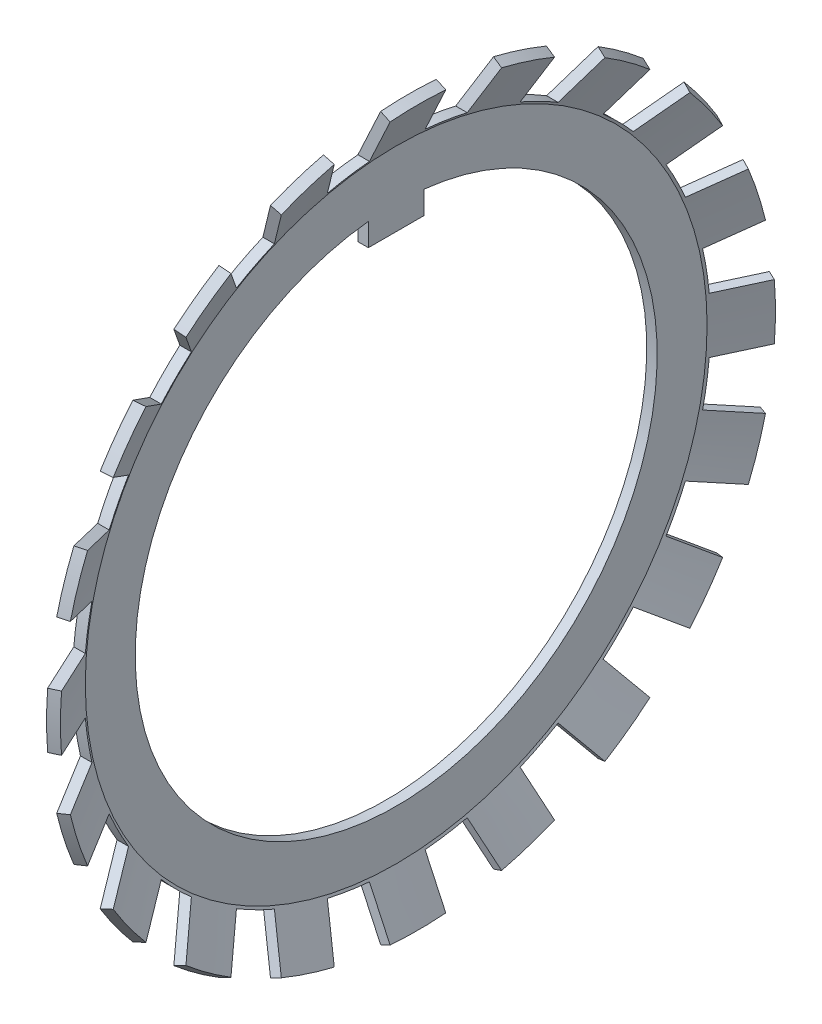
from build123d import *

# Parameters (mm, degrees)
ENL_V_MAT_EXTRU_1_DEPTH = 1.5
ESQUISSE3_W             = 228.8
ESQUISSE3_H             = 228.8
ENL_V_MAT_EXTRU_2_DEPTH = 71.5


with BuildPart() as part:
    # Esquisse1 → R_volution1 (revolve)
    with BuildSketch(Plane.XY, mode=Mode.PRIVATE) as r_volution1_sk:
        Polygon((0, 0), (0, 45), (3.264153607, 52), (4.623615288, 51.366072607), (1.5, 44.667458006), (1.5, 0), align=None)
    revolve(r_volution1_sk.sketch.rotate(Axis((1.5, 0, 0), (-1, 0, 0)), 270), axis=Axis((1.5, 0, 0), (-1, 0, 0)))

    # Esquisse2 → Enl_v. mat.-Extru.1 (cut)
    with BuildSketch(Plane(origin=(0, 0, 0), x_dir=(0, 0, -1), z_dir=(1, 0, 0))):
        with BuildLine():
            Line((4, 37.286056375), (4, 34))
            Line((4, 34), (-4, 34))
            Line((-4, 34), (-4, 37.286056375))
            ThreePointArc((-4, 37.286056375), (0, -37.5), (4, 37.286056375))
        make_face()
    extrude(amount=ENL_V_MAT_EXTRU_1_DEPTH, mode=Mode.SUBTRACT)

    # Esquisse3 → Enl_v. mat.-Extru.2 (cut)
    with BuildSketch(Plane(origin=(0, 0, 0), x_dir=(0, 0, -1), z_dir=(1, 0, 0))):
        Rectangle(ESQUISSE3_W, ESQUISSE3_H)
        with BuildLine():
            Line((-51.845925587, -4), (-44.821869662, -4))
            ThreePointArc((-44.821869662, -4), (-44.445975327, -7.039550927), (-43.864199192, -10.04649338))
            Line((-43.864199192, -10.04649338), (-50.544473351, -12.21704603))
            ThreePointArc((-50.544473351, -12.21704603), (-49.454938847, -16.068883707), (-48.072337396, -19.825498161))
            Line((-48.072337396, -19.825498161), (-41.392063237, -17.65494551))
            ThreePointArc((-41.392063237, -17.65494551), (-40.095293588, -20.429572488), (-38.612795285, -23.10956599))
            Line((-38.612795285, -23.10956599), (-44.295375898, -27.238202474))
            ThreePointArc((-44.295375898, -27.238202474), (-42.068883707, -30.564833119), (-39.59309388, -33.710338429))
            Line((-39.59309388, -33.710338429), (-33.910513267, -29.581701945))
            ThreePointArc((-33.910513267, -29.581701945), (-31.819805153, -31.819805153), (-29.581701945, -33.910513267))
            Line((-29.581701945, -33.910513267), (-33.710338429, -39.59309388))
            ThreePointArc((-33.710338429, -39.59309388), (-30.564833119, -42.068883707), (-27.238202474, -44.295375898))
            Line((-27.238202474, -44.295375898), (-23.10956599, -38.612795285))
            ThreePointArc((-23.10956599, -38.612795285), (-20.429572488, -40.095293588), (-17.65494551, -41.392063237))
            Line((-17.65494551, -41.392063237), (-19.825498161, -48.072337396))
            ThreePointArc((-19.825498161, -48.072337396), (-16.068883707, -49.454938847), (-12.21704603, -50.544473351))
            Line((-12.21704603, -50.544473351), (-10.04649338, -43.864199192))
            ThreePointArc((-10.04649338, -43.864199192), (-7.039550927, -44.445975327), (-4, -44.821869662))
            Line((-4, -44.821869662), (-4, -51.845925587))
            ThreePointArc((-4, -51.845925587), (0, -52), (4, -51.845925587))
            Line((4, -51.845925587), (4, -44.821869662))
            ThreePointArc((4, -44.821869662), (7.039550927, -44.445975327), (10.04649338, -43.864199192))
            Line((10.04649338, -43.864199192), (12.21704603, -50.544473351))
            ThreePointArc((12.21704603, -50.544473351), (16.068883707, -49.454938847), (19.825498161, -48.072337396))
            Line((19.825498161, -48.072337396), (17.65494551, -41.392063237))
            ThreePointArc((17.65494551, -41.392063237), (20.429572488, -40.095293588), (23.10956599, -38.612795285))
            Line((23.10956599, -38.612795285), (27.238202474, -44.295375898))
            ThreePointArc((27.238202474, -44.295375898), (30.564833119, -42.068883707), (33.710338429, -39.59309388))
            Line((33.710338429, -39.59309388), (29.581701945, -33.910513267))
            ThreePointArc((29.581701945, -33.910513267), (31.819805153, -31.819805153), (33.910513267, -29.581701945))
            Line((33.910513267, -29.581701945), (39.59309388, -33.710338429))
            ThreePointArc((39.59309388, -33.710338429), (42.068883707, -30.564833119), (44.295375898, -27.238202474))
            Line((44.295375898, -27.238202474), (38.612795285, -23.10956599))
            ThreePointArc((38.612795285, -23.10956599), (40.095293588, -20.429572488), (41.392063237, -17.65494551))
            Line((41.392063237, -17.65494551), (48.072337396, -19.825498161))
            ThreePointArc((48.072337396, -19.825498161), (49.454938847, -16.068883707), (50.544473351, -12.21704603))
            Line((50.544473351, -12.21704603), (43.864199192, -10.04649338))
            ThreePointArc((43.864199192, -10.04649338), (44.445975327, -7.039550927), (44.821869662, -4))
            Line((44.821869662, -4), (51.845925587, -4))
            ThreePointArc((51.845925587, -4), (52, 0), (51.845925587, 4))
            Line((51.845925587, 4), (44.821869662, 4))
            ThreePointArc((44.821869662, 4), (44.445975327, 7.039550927), (43.864199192, 10.04649338))
            Line((43.864199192, 10.04649338), (50.544473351, 12.21704603))
            ThreePointArc((50.544473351, 12.21704603), (49.454938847, 16.068883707), (48.072337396, 19.825498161))
            Line((48.072337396, 19.825498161), (41.392063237, 17.65494551))
            ThreePointArc((41.392063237, 17.65494551), (40.095293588, 20.429572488), (38.612795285, 23.10956599))
            Line((38.612795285, 23.10956599), (44.295375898, 27.238202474))
            ThreePointArc((44.295375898, 27.238202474), (42.068883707, 30.564833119), (39.59309388, 33.710338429))
            Line((39.59309388, 33.710338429), (33.910513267, 29.581701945))
            ThreePointArc((33.910513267, 29.581701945), (31.819805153, 31.819805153), (29.581701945, 33.910513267))
            Line((29.581701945, 33.910513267), (33.710338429, 39.59309388))
            ThreePointArc((33.710338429, 39.59309388), (30.564833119, 42.068883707), (27.238202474, 44.295375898))
            Line((27.238202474, 44.295375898), (23.10956599, 38.612795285))
            ThreePointArc((23.10956599, 38.612795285), (20.429572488, 40.095293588), (17.65494551, 41.392063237))
            Line((17.65494551, 41.392063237), (19.825498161, 48.072337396))
            ThreePointArc((19.825498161, 48.072337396), (16.068883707, 49.454938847), (12.21704603, 50.544473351))
            Line((12.21704603, 50.544473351), (10.04649338, 43.864199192))
            ThreePointArc((10.04649338, 43.864199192), (7.039550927, 44.445975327), (4, 44.821869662))
            Line((4, 44.821869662), (4, 51.845925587))
            ThreePointArc((4, 51.845925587), (0, 52), (-4, 51.845925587))
            Line((-4, 51.845925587), (-4, 44.821869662))
            ThreePointArc((-4, 44.821869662), (-7.039550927, 44.445975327), (-10.04649338, 43.864199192))
            Line((-10.04649338, 43.864199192), (-12.21704603, 50.544473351))
            ThreePointArc((-12.21704603, 50.544473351), (-16.068883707, 49.454938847), (-19.825498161, 48.072337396))
            Line((-19.825498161, 48.072337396), (-17.65494551, 41.392063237))
            ThreePointArc((-17.65494551, 41.392063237), (-20.429572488, 40.095293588), (-23.10956599, 38.612795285))
            Line((-23.10956599, 38.612795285), (-27.238202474, 44.295375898))
            ThreePointArc((-27.238202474, 44.295375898), (-30.564833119, 42.068883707), (-33.710338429, 39.59309388))
            Line((-33.710338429, 39.59309388), (-29.581701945, 33.910513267))
            ThreePointArc((-29.581701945, 33.910513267), (-31.819805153, 31.819805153), (-33.910513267, 29.581701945))
            Line((-33.910513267, 29.581701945), (-39.59309388, 33.710338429))
            ThreePointArc((-39.59309388, 33.710338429), (-42.068883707, 30.564833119), (-44.295375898, 27.238202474))
            Line((-44.295375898, 27.238202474), (-38.612795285, 23.10956599))
            ThreePointArc((-38.612795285, 23.10956599), (-40.095293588, 20.429572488), (-41.392063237, 17.65494551))
            Line((-41.392063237, 17.65494551), (-48.072337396, 19.825498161))
            ThreePointArc((-48.072337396, 19.825498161), (-49.454938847, 16.068883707), (-50.544473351, 12.21704603))
            Line((-50.544473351, 12.21704603), (-43.864199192, 10.04649338))
            ThreePointArc((-43.864199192, 10.04649338), (-44.445975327, 7.039550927), (-44.821869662, 4))
            Line((-44.821869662, 4), (-51.845925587, 4))
            ThreePointArc((-51.845925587, 4), (-52, 0), (-51.845925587, -4))
        make_face(mode=Mode.SUBTRACT)
    extrude(amount=ENL_V_MAT_EXTRU_2_DEPTH, mode=Mode.SUBTRACT)


solid = part.part
